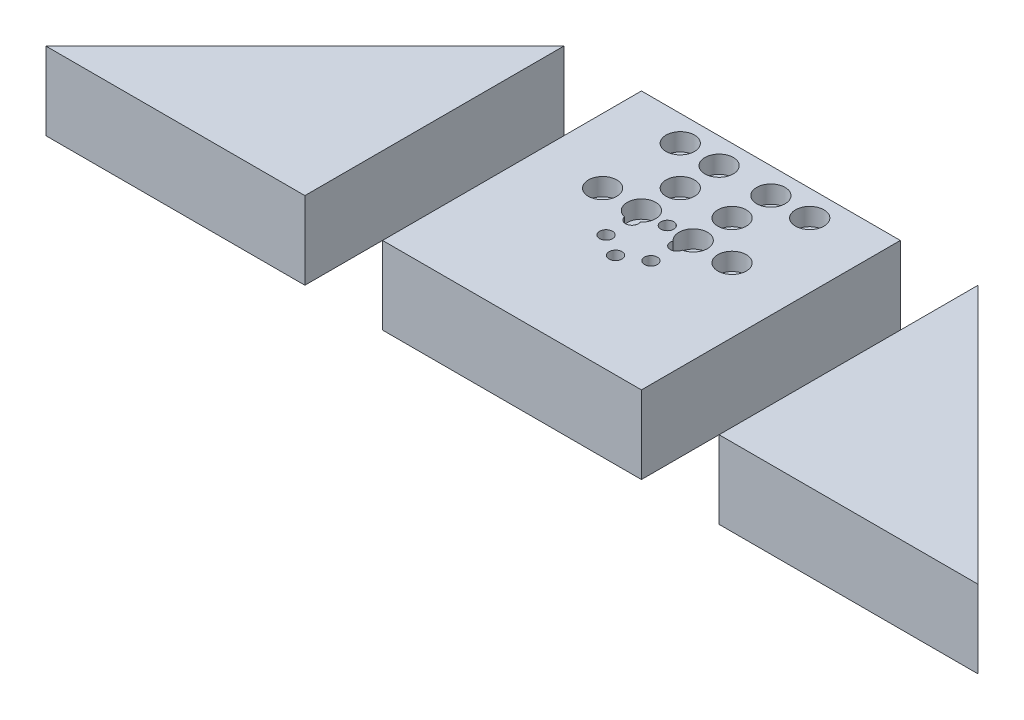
from build123d import *

# Parameters (mm, degrees)
EXTRUDE_1_DEPTH             = 30
SKETCH_1_W                  = 100
SKETCH_1_H                  = 100
EXTRUDE_1_2_DEPTH           = 30
SKETCH_11_W                 = 2.5
SKETCH_11_H                 = 30
PATTERN_LINEAR_1_COUNT      = 2
PATTERN_LINEAR_1_PITCH      = 15
PATTERN_LINEAR_1_COUNT_DIR2 = 3
PATTERN_LINEAR_1_PITCH_DIR2 = 15
PATTERN_CIRCULAR_1_COUNT    = 6


with BuildPart() as part:
    # Sketch 1 → Extrude 1 (new body)
    with BuildSketch(Plane(origin=(0, 0, 0), x_dir=(1, 0, 0), z_dir=(0, 1, 0))):
        Polygon((80, -50), (180, -50), (80, 50), align=None)
    extrude(amount=EXTRUDE_1_DEPTH)


with BuildPart() as body_2:
    # Sketch 1 → Extrude 1 2 (new body)
    with BuildSketch(Plane(origin=(0, 0, 0), x_dir=(1, 0, 0), z_dir=(0, 1, 0))):
        Rectangle(SKETCH_1_W, SKETCH_1_H)
    extrude(amount=EXTRUDE_1_2_DEPTH)

    # Sketch 4 → Hole Wizard 1 (revolve, cut)
    with BuildSketch(Plane(origin=(-25, 30, -10), x_dir=(0, 0, 1), z_dir=(1, 0, 0))):
        Polygon((0, 0), (0, 30), (3.3, 30), (3.3, 6.8), (5.5, 6.8), (5.5, 0), align=None)
    hole_wizard_1 = revolve(axis=Axis((-25, 36.35, -10), (0, -1, 0)), mode=Mode.SUBTRACT)

    # Sketch 11 → Hole Wizard M6 _1 (revolve, cut)
    with BuildSketch(Plane(origin=(0, 30, -10), x_dir=(0, 0, 1), z_dir=(1, 0, 0))):
        with Locations((1.25, 15)):
            Rectangle(SKETCH_11_W, SKETCH_11_H)
    hole_wizard_m6_1 = revolve(axis=Axis((0, 36.35, -10), (0, -1, 0)), mode=Mode.SUBTRACT)

    # Pattern Linear 1: Hole Wizard 1 2 × 3, 1 skipped
    with Locations(*[(i * PATTERN_LINEAR_1_PITCH, 0, -j * PATTERN_LINEAR_1_PITCH_DIR2) for i in range(PATTERN_LINEAR_1_COUNT) for j in range(PATTERN_LINEAR_1_COUNT_DIR2) if (i, j) not in ((0, 0), (0, 1))]):
        add(hole_wizard_1, mode=Mode.SUBTRACT)

    # Pattern Circular 1: Hole Wizard M6 _1 ×6 about axis
    pattern_circular_1_axis = Axis((0, 0, 0), (0, 1, 0))
    for i in range(1, PATTERN_CIRCULAR_1_COUNT):
        add(hole_wizard_m6_1.rotate(pattern_circular_1_axis, i * 360 / PATTERN_CIRCULAR_1_COUNT), mode=Mode.SUBTRACT)

    # Mirror 3: Hole Wizard 1 across plane
    add(hole_wizard_1.mirror(Plane(origin=(0, 0, 0), x_dir=(0, 0, 1), z_dir=(1, 0, 0))), mode=Mode.SUBTRACT)

    # Mirror 3 copy 1 sketch → Mirror 3 copy 1 (revolve, cut)
    with BuildSketch(Plane(origin=(25, 30, -40), x_dir=(0, 0, 1), z_dir=(-1, 0, 0))):
        Polygon((0, 0), (0, -30), (3.3, -30), (3.3, -6.8), (5.5, -6.8), (5.5, 0), align=None)
    revolve(axis=Axis((25, 36.35, -40), (0, 1, 0)), mode=Mode.SUBTRACT)

    # Mirror 3 copy 2 sketch → Mirror 3 copy 2 (revolve, cut)
    with BuildSketch(Plane(origin=(10, 30, -10), x_dir=(0, 0, 1), z_dir=(-1, 0, 0))):
        Polygon((0, 0), (0, -30), (3.3, -30), (3.3, -6.8), (5.5, -6.8), (5.5, 0), align=None)
    revolve(axis=Axis((10, 36.35, -10), (0, 1, 0)), mode=Mode.SUBTRACT)

    # Mirror 3 copy 3 sketch → Mirror 3 copy 3 (revolve, cut)
    with BuildSketch(Plane(origin=(10, 30, -25), x_dir=(0, 0, 1), z_dir=(-1, 0, 0))):
        Polygon((0, 0), (0, -30), (3.3, -30), (3.3, -6.8), (5.5, -6.8), (5.5, 0), align=None)
    revolve(axis=Axis((10, 36.35, -25), (0, 1, 0)), mode=Mode.SUBTRACT)

    # Mirror 3 copy 4 sketch → Mirror 3 copy 4 (revolve, cut)
    with BuildSketch(Plane(origin=(10, 30, -40), x_dir=(0, 0, 1), z_dir=(-1, 0, 0))):
        Polygon((0, 0), (0, -30), (3.3, -30), (3.3, -6.8), (5.5, -6.8), (5.5, 0), align=None)
    revolve(axis=Axis((10, 36.35, -40), (0, 1, 0)), mode=Mode.SUBTRACT)


with BuildPart() as body_3:
    # Mirror 5: mirrored copy
    add(part.part.mirror(Plane(origin=(0, 0, 0), x_dir=(0, 0, 1), z_dir=(1, 0, 0))))


solid = Compound([part.part, body_2.part, body_3.part])
